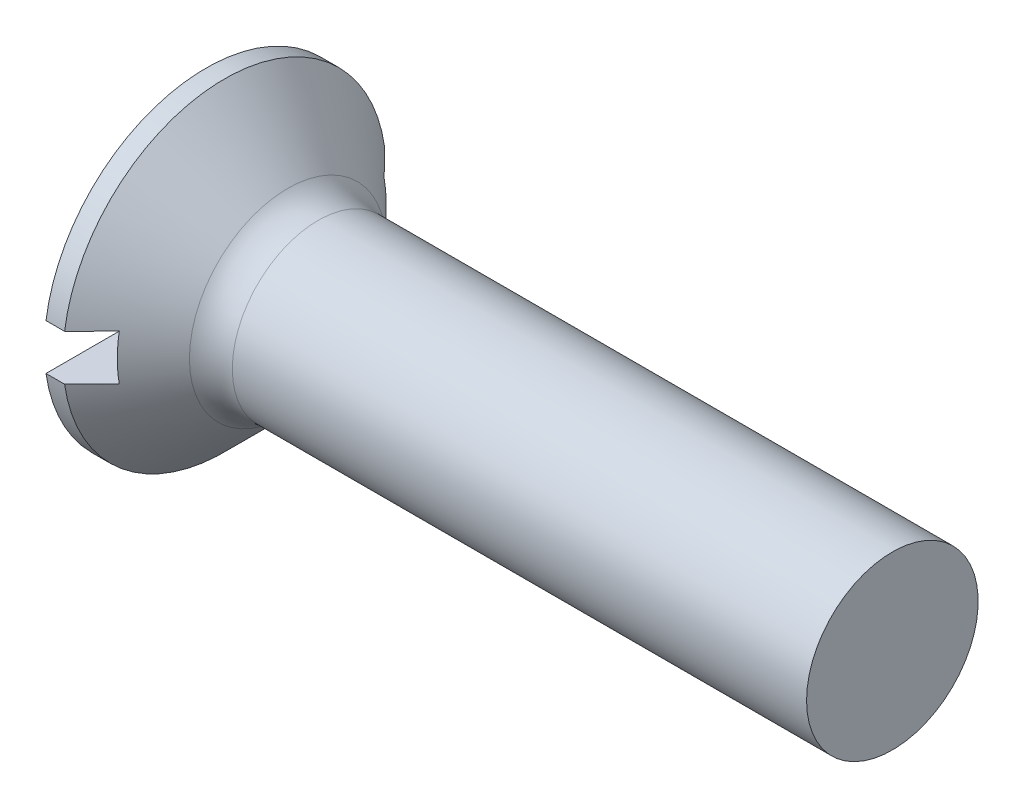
ISO-10303-21;
HEADER;
FILE_DESCRIPTION(('STEP AP214'),'2;1');
FILE_NAME('part.step','',(''),(''),'','','');
FILE_SCHEMA(('AUTOMOTIVE_DESIGN { 1 0 10303 214 1 1 1 1 }'));
ENDSEC;
DATA;
#1=APPLICATION_CONTEXT('core data for automotive mechanical design processes');
#2=APPLICATION_PROTOCOL_DEFINITION('international standard','automotive_design',2000,#1);
#3=PRODUCT_CONTEXT('',#1,'mechanical');
#4=PRODUCT('Part','Part','',(#3));
#5=PRODUCT_RELATED_PRODUCT_CATEGORY('part','',(#4));
#6=PRODUCT_DEFINITION_FORMATION('','',#4);
#7=PRODUCT_DEFINITION_CONTEXT('part definition',#1,'design');
#8=PRODUCT_DEFINITION('design','',#6,#7);
#9=PRODUCT_DEFINITION_SHAPE('','',#8);
#10=(LENGTH_UNIT() NAMED_UNIT(*) SI_UNIT(.MILLI.,.METRE.));
#11=(NAMED_UNIT(*) PLANE_ANGLE_UNIT() SI_UNIT($,.RADIAN.));
#12=(NAMED_UNIT(*) SI_UNIT($,.STERADIAN.) SOLID_ANGLE_UNIT());
#13=UNCERTAINTY_MEASURE_WITH_UNIT(LENGTH_MEASURE(1.E-05),#10,'distance_accuracy_value','');
#14=(GEOMETRIC_REPRESENTATION_CONTEXT(3) GLOBAL_UNCERTAINTY_ASSIGNED_CONTEXT((#13)) GLOBAL_UNIT_ASSIGNED_CONTEXT((#10,
#11,#12)) REPRESENTATION_CONTEXT('',''));
#15=CARTESIAN_POINT('',(0.,0.,0.));
#16=DIRECTION('',(0.,0.,1.));
#17=DIRECTION('',(1.,0.,0.));
#18=AXIS2_PLACEMENT_3D('',#15,#16,#17);
#19=CARTESIAN_POINT('',(0.,0.,0.));
#20=DIRECTION('',(-1.,0.,0.));
#21=DIRECTION('',(0.,0.,1.));
#22=AXIS2_PLACEMENT_3D('',#19,#20,#21);
#23=PLANE('',#22);
#24=DIRECTION('',(0.,0.,-1.));
#25=VECTOR('',#24,1.);
#26=CARTESIAN_POINT('',(0.,0.800000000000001,5.65));
#27=LINE('',#26,#25);
#28=CARTESIAN_POINT('',(0.,0.800000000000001,5.593076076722));
#29=VERTEX_POINT('',#28);
#30=CARTESIAN_POINT('',(0.,0.799999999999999,-5.593076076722));
#31=VERTEX_POINT('',#30);
#32=EDGE_CURVE('E170',#29,#31,#27,.T.);
#33=ORIENTED_EDGE('',*,*,#32,.F.);
#34=CARTESIAN_POINT('',(0.,0.,0.));
#35=DIRECTION('',(-1.,0.,0.));
#36=DIRECTION('',(0.,0.,1.));
#37=AXIS2_PLACEMENT_3D('',#34,#35,#36);
#38=CIRCLE('',#37,5.65);
#39=EDGE_CURVE('E114',#29,#31,#38,.T.);
#40=ORIENTED_EDGE('',*,*,#39,.T.);
#41=EDGE_LOOP('',(#33,#40));
#42=FACE_BOUND('',#41,.T.);
#43=ADVANCED_FACE('F33',(#42),#23,.T.);
#44=CARTESIAN_POINT('',(-6.34999999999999,0.,0.));
#45=DIRECTION('',(-1.,0.,0.));
#46=DIRECTION('',(0.,0.,1.));
#47=AXIS2_PLACEMENT_3D('',#44,#45,#46);
#48=CYLINDRICAL_SURFACE('',#47,5.65);
#49=DIRECTION('',(-1.,0.,0.));
#50=VECTOR('',#49,1.);
#51=CARTESIAN_POINT('',(-6.34999999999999,0.799999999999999,-5.593076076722));
#52=LINE('',#51,#50);
#53=CARTESIAN_POINT('',(0.650000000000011,0.799999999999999,-5.593076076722));
#54=VERTEX_POINT('',#53);
#55=EDGE_CURVE('E61',#31,#54,#52,.F.);
#56=ORIENTED_EDGE('',*,*,#55,.F.);
#57=ORIENTED_EDGE('',*,*,#39,.F.);
#58=DIRECTION('',(-1.,0.,0.));
#59=VECTOR('',#58,1.);
#60=CARTESIAN_POINT('',(-6.34999999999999,0.800000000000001,5.593076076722));
#61=LINE('',#60,#59);
#62=CARTESIAN_POINT('',(0.650000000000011,0.800000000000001,5.59307607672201));
#63=VERTEX_POINT('',#62);
#64=EDGE_CURVE('E176',#63,#29,#61,.T.);
#65=ORIENTED_EDGE('',*,*,#64,.F.);
#66=CARTESIAN_POINT('',(0.650000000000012,0.,0.));
#67=DIRECTION('',(-1.,0.,0.));
#68=DIRECTION('',(0.,0.,1.));
#69=AXIS2_PLACEMENT_3D('',#66,#67,#68);
#70=CIRCLE('',#69,5.65);
#71=EDGE_CURVE('E108',#63,#54,#70,.T.);
#72=ORIENTED_EDGE('',*,*,#71,.T.);
#73=EDGE_LOOP('',(#56,#57,#65,#72));
#74=FACE_BOUND('',#73,.T.);
#75=ADVANCED_FACE('F154',(#74),#48,.T.);
#76=DIRECTION('',(0.,0.,1.));
#77=VECTOR('',#76,1.);
#78=CARTESIAN_POINT('',(0.,-0.800000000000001,-5.65));
#79=LINE('',#78,#77);
#80=CARTESIAN_POINT('',(0.,-0.800000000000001,-5.593076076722));
#81=VERTEX_POINT('',#80);
#82=CARTESIAN_POINT('',(0.,-0.800000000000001,5.593076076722));
#83=VERTEX_POINT('',#82);
#84=EDGE_CURVE('E102',#81,#83,#79,.T.);
#85=ORIENTED_EDGE('',*,*,#84,.F.);
#86=EDGE_CURVE('E110',#81,#83,#38,.T.);
#87=ORIENTED_EDGE('',*,*,#86,.T.);
#88=EDGE_LOOP('',(#85,#87));
#89=FACE_BOUND('',#88,.T.);
#90=ADVANCED_FACE('F156',(#89),#23,.T.);
#91=DIRECTION('',(-1.,0.,0.));
#92=VECTOR('',#91,1.);
#93=CARTESIAN_POINT('',(-6.34999999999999,-0.800000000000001,5.593076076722));
#94=LINE('',#93,#92);
#95=CARTESIAN_POINT('',(0.650000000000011,-0.800000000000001,5.593076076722));
#96=VERTEX_POINT('',#95);
#97=EDGE_CURVE('E175',#83,#96,#94,.F.);
#98=ORIENTED_EDGE('',*,*,#97,.F.);
#99=ORIENTED_EDGE('',*,*,#86,.F.);
#100=DIRECTION('',(-1.,0.,0.));
#101=VECTOR('',#100,1.);
#102=CARTESIAN_POINT('',(-6.34999999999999,-0.800000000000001,-5.593076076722));
#103=LINE('',#102,#101);
#104=CARTESIAN_POINT('',(0.650000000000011,-0.800000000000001,-5.59307607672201));
#105=VERTEX_POINT('',#104);
#106=EDGE_CURVE('E173',#105,#81,#103,.T.);
#107=ORIENTED_EDGE('',*,*,#106,.F.);
#108=EDGE_CURVE('E111',#105,#96,#70,.T.);
#109=ORIENTED_EDGE('',*,*,#108,.T.);
#110=EDGE_LOOP('',(#98,#99,#107,#109));
#111=FACE_BOUND('',#110,.T.);
#112=ADVANCED_FACE('F151',(#111),#48,.T.);
#113=CARTESIAN_POINT('',(0.650000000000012,0.,0.));
#114=DIRECTION('',(-1.,0.,0.));
#115=DIRECTION('',(0.,0.,1.));
#116=AXIS2_PLACEMENT_3D('',#113,#114,#115);
#117=CONICAL_SURFACE('',#116,5.65,0.78539816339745);
#118=CARTESIAN_POINT('',(-6.15411798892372,0.799999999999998,-12.4283971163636));
#119=CARTESIAN_POINT('',(-5.72840936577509,0.799999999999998,-12.0018006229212));
#120=CARTESIAN_POINT('',(-5.30273955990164,0.799999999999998,-11.5751653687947));
#121=CARTESIAN_POINT('',(-4.45151919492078,0.799999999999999,-10.7217600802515));
#122=CARTESIAN_POINT('',(-4.0259686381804,0.799999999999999,-10.2949900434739));
#123=CARTESIAN_POINT('',(-3.17486613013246,0.799999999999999,-9.44109511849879));
#124=CARTESIAN_POINT('',(-2.74931425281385,0.799999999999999,-9.01397015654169));
#125=CARTESIAN_POINT('',(-1.89848797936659,0.799999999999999,-8.15945937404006));
#126=CARTESIAN_POINT('',(-1.47321357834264,0.799999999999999,-7.73207355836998));
#127=CARTESIAN_POINT('',(-0.615833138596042,0.799999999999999,-6.86957346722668));
#128=CARTESIAN_POINT('',(-0.183734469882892,0.799999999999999,-6.43445186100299));
#129=CARTESIAN_POINT('',(0.463821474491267,0.799999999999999,-5.78115808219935));
#130=CARTESIAN_POINT('',(0.679580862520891,0.799999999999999,-5.56328543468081));
#131=CARTESIAN_POINT('',(1.11080934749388,0.799999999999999,-5.12725542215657));
#132=CARTESIAN_POINT('',(1.32627844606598,0.799999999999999,-4.90909805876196));
#133=CARTESIAN_POINT('',(1.75673850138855,0.799999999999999,-4.4724245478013));
#134=CARTESIAN_POINT('',(1.9717295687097,0.799999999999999,-4.25390850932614));
#135=CARTESIAN_POINT('',(2.40105661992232,0.799999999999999,-3.81622451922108));
#136=CARTESIAN_POINT('',(2.61539258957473,0.799999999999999,-3.5970565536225));
#137=CARTESIAN_POINT('',(3.04295786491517,0.799999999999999,-3.15768240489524));
#138=CARTESIAN_POINT('',(3.25618727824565,0.8,-2.93747632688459));
#139=CARTESIAN_POINT('',(3.5744618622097,0.8,-2.60566790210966));
#140=CARTESIAN_POINT('',(3.68028997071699,0.8,-2.49481715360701));
#141=CARTESIAN_POINT('',(3.89117220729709,0.8,-2.27238250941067));
#142=CARTESIAN_POINT('',(3.9962263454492,0.8,-2.16079862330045));
#143=CARTESIAN_POINT('',(4.15723188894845,0.8,-1.98794766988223));
#144=CARTESIAN_POINT('',(4.2136059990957,0.8,-1.92707456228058));
#145=CARTESIAN_POINT('',(4.32589442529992,0.8,-1.80490303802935));
#146=CARTESIAN_POINT('',(4.38180873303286,0.8,-1.74360461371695));
#147=CARTESIAN_POINT('',(4.4929680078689,0.8,-1.62051315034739));
#148=CARTESIAN_POINT('',(4.54821358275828,0.8,-1.55872066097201));
#149=CARTESIAN_POINT('',(4.65786130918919,0.8,-1.43439270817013));
#150=CARTESIAN_POINT('',(4.71226349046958,0.8,-1.37185727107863));
#151=CARTESIAN_POINT('',(4.80409800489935,0.8,-1.26422341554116));
#152=CARTESIAN_POINT('',(4.84183289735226,0.8,-1.21938356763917));
#153=CARTESIAN_POINT('',(4.91649705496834,0.8,-1.12903902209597));
#154=CARTESIAN_POINT('',(4.9534263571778,0.8,-1.08353435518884));
#155=CARTESIAN_POINT('',(5.02626757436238,0.8,-0.991556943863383));
#156=CARTESIAN_POINT('',(5.06217715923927,0.8,-0.945082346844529));
#157=CARTESIAN_POINT('',(5.13244697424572,0.8,-0.850978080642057));
#158=CARTESIAN_POINT('',(5.16680749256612,0.8,-0.803348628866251));
#159=CARTESIAN_POINT('',(5.22431678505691,0.8,-0.719551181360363));
#160=CARTESIAN_POINT('',(5.24799439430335,0.8,-0.683748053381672));
#161=CARTESIAN_POINT('',(5.29369463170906,0.8,-0.611104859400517));
#162=CARTESIAN_POINT('',(5.31571771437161,0.8,-0.574265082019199));
#163=CARTESIAN_POINT('',(5.35744088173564,0.8,-0.499381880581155));
#164=CARTESIAN_POINT('',(5.3771460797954,0.8,-0.461341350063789));
#165=CARTESIAN_POINT('',(5.41336597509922,0.8,-0.383789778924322));
#166=CARTESIAN_POINT('',(5.42988361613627,0.8,-0.344280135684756));
#167=CARTESIAN_POINT('',(5.46094186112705,0.8,-0.256815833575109));
#168=CARTESIAN_POINT('',(5.47467792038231,0.8,-0.20856153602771));
#169=CARTESIAN_POINT('',(5.49381672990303,0.8,-0.110515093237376));
#170=CARTESIAN_POINT('',(5.49925037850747,0.8,-0.060729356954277));
#171=CARTESIAN_POINT('',(5.50060502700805,0.8,0.0392177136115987));
#172=CARTESIAN_POINT('',(5.49648099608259,0.8,0.0893797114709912));
#173=CARTESIAN_POINT('',(5.47960475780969,0.8,0.188284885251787));
#174=CARTESIAN_POINT('',(5.46682661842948,0.8,0.237023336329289));
#175=CARTESIAN_POINT('',(5.43411335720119,0.8,0.334650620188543));
#176=CARTESIAN_POINT('',(5.41385237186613,0.8,0.383425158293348));
#177=CARTESIAN_POINT('',(5.36862340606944,0.8,0.478778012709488));
#178=CARTESIAN_POINT('',(5.34364665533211,0.8,0.525352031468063));
#179=CARTESIAN_POINT('',(5.29038044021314,0.8,0.617035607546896));
#180=CARTESIAN_POINT('',(5.26206586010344,0.8,0.662130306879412));
#181=CARTESIAN_POINT('',(5.20333288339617,0.8,0.750853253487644));
#182=CARTESIAN_POINT('',(5.1729163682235,0.8,0.794482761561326));
#183=CARTESIAN_POINT('',(5.10778188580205,0.8,0.884555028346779));
#184=CARTESIAN_POINT('',(5.0729236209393,0.8,0.930895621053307));
#185=CARTESIAN_POINT('',(5.00196098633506,0.8,1.02261602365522));
#186=CARTESIAN_POINT('',(4.96585645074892,0.8,1.06799570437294));
#187=CARTESIAN_POINT('',(4.85617422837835,0.8,1.20309114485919));
#188=CARTESIAN_POINT('',(4.78126095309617,0.8,1.2917191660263));
#189=CARTESIAN_POINT('',(4.62929001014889,0.8,1.46737217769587));
#190=CARTESIAN_POINT('',(4.55222874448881,0.8,1.5543940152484));
#191=CARTESIAN_POINT('',(4.39684690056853,0.8,1.72725932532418));
#192=CARTESIAN_POINT('',(4.31852668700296,0.8,1.81310312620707));
#193=CARTESIAN_POINT('',(4.16128761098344,0.8,1.9837284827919));
#194=CARTESIAN_POINT('',(4.0823714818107,0.8,2.06851256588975));
#195=CARTESIAN_POINT('',(3.92393847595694,0.8,2.23752833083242));
#196=CARTESIAN_POINT('',(3.84442155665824,0.8,2.32175997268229));
#197=CARTESIAN_POINT('',(3.68503997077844,0.8,2.48972216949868));
#198=CARTESIAN_POINT('',(3.60517576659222,0.8,2.57345316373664));
#199=CARTESIAN_POINT('',(3.44512383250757,0.8,2.74060127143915));
#200=CARTESIAN_POINT('',(3.36493611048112,0.8,2.82401839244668));
#201=CARTESIAN_POINT('',(3.12470885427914,0.8,3.07317891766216));
#202=CARTESIAN_POINT('',(2.96430275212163,0.8,3.23856877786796));
#203=CARTESIAN_POINT('',(2.64287426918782,0.8,3.56874884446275));
#204=CARTESIAN_POINT('',(2.4818518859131,0.8,3.73353904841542));
#205=CARTESIAN_POINT('',(1.9981683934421,0.8,4.22731783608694));
#206=CARTESIAN_POINT('',(1.67489699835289,0.8,4.55570835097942));
#207=CARTESIAN_POINT('',(1.02739846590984,0.8,5.21181717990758));
#208=CARTESIAN_POINT('',(0.70317098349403,0.800000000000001,5.53953515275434));
#209=CARTESIAN_POINT('',(0.0542289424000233,0.800000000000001,6.1944827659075));
#210=CARTESIAN_POINT('',(-0.270485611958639,0.800000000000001,6.52171241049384));
#211=CARTESIAN_POINT('',(-0.920234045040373,0.800000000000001,7.17587674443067));
#212=CARTESIAN_POINT('',(-1.24526793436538,0.800000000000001,7.50281142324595));
#213=CARTESIAN_POINT('',(-1.8955454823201,0.800000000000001,8.15647358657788));
#214=CARTESIAN_POINT('',(-2.220789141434,0.800000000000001,8.48320107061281));
#215=CARTESIAN_POINT('',(-3.19666835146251,0.800000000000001,9.46309907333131));
#216=CARTESIAN_POINT('',(-3.84752047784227,0.800000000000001,10.1160538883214));
#217=CARTESIAN_POINT('',(-4.6364721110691,0.800000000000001,10.9071774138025));
#218=CARTESIAN_POINT('',(-4.77442315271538,0.800000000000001,11.0454942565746));
#219=CARTESIAN_POINT('',(-5.05034059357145,0.800000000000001,11.3221169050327));
#220=CARTESIAN_POINT('',(-5.18830699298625,0.800000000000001,11.4604227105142));
#221=CARTESIAN_POINT('',(-5.46424249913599,0.800000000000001,11.7370137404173));
#222=CARTESIAN_POINT('',(-5.60221160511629,0.800000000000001,11.8752989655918));
#223=CARTESIAN_POINT('',(-5.8781582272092,0.800000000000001,12.1518567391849));
#224=CARTESIAN_POINT('',(-6.01613574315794,0.800000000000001,12.2901292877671));
#225=CARTESIAN_POINT('',(-6.15411798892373,0.800000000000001,12.4283971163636));
#226=B_SPLINE_CURVE_WITH_KNOTS('',3,(#118,#119,#120,#121,#122,#123,#124,#125,#126,#127,#128,
#129,#130,#131,#132,#133,#134,#135,#136,#137,#138,#139,#140,#141,#142,#143,#144,#145,#146,#147,
#148,#149,#150,#151,#152,#153,#154,#155,#156,#157,#158,#159,#160,#161,#162,#163,#164,#165,#166,
#167,#168,#169,#170,#171,#172,#173,#174,#175,#176,#177,#178,#179,#180,#181,#182,#183,#184,#185,
#186,#187,#188,#189,#190,#191,#192,#193,#194,#195,#196,#197,#198,#199,#200,#201,#202,#203,#204,
#205,#206,#207,#208,#209,#210,#211,#212,#213,#214,#215,#216,#217,#218,#219,#220,#221,#222,#223,
#224,#225),.UNSPECIFIED.,.F.,.F.,(4,2,2,2,2,2,2,2,2,2,2,2,2,2,2,2,2,2,2,2,2,2,2,2,2,2,2,2,2,2,2,
2,2,2,2,2,2,2,2,2,2,2,2,2,2,2,2,2,2,2,2,2,2,4),(0.,1.80801318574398,3.61606002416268,
5.42486373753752,7.23363462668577,9.07329711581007,9.9931803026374,10.9130583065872,
11.8326950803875,12.7523517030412,13.6719171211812,14.1316838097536,14.5914445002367,
14.8403447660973,15.0892495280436,15.337907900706,15.5865574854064,15.7623655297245,
15.9381654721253,16.1143391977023,16.2904800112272,16.4192204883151,16.5479254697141,
16.6763409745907,16.8046373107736,16.9545930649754,17.1039893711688,17.2540909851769,
17.4046443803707,17.5627244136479,17.7211013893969,17.8807569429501,18.0402713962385,
18.2142039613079,18.3881597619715,18.7362365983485,19.0849364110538,19.4335369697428,
19.7810170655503,20.1285220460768,20.4756556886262,20.8227809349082,21.5139763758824,
22.2051746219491,23.5875972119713,24.9706017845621,26.3535941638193,27.7366341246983,
29.1196772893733,31.8854728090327,32.4715260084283,33.0575882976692,33.6436126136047,
34.2296278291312),.UNSPECIFIED.);
#227=CARTESIAN_POINT('',(1.6,0.8,4.63141447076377));
#228=VERTEX_POINT('',#227);
#229=EDGE_CURVE('E11',#228,#63,#226,.T.);
#230=ORIENTED_EDGE('',*,*,#229,.F.);
#231=CARTESIAN_POINT('',(1.6,0.,0.));
#232=DIRECTION('',(1.,0.,0.));
#233=DIRECTION('',(0.,0.,-1.));
#234=AXIS2_PLACEMENT_3D('',#231,#232,#233);
#235=CIRCLE('',#234,4.70000000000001);
#236=CARTESIAN_POINT('',(1.6,-0.800000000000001,4.63141447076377));
#237=VERTEX_POINT('',#236);
#238=EDGE_CURVE('E90',#237,#228,#235,.F.);
#239=ORIENTED_EDGE('',*,*,#238,.F.);
#240=CARTESIAN_POINT('',(-6.15411798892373,-0.800000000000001,12.4283971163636));
#241=CARTESIAN_POINT('',(-5.7284093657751,-0.800000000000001,12.0018006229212));
#242=CARTESIAN_POINT('',(-5.30273955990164,-0.800000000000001,11.5751653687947));
#243=CARTESIAN_POINT('',(-4.45151919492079,-0.800000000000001,10.7217600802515));
#244=CARTESIAN_POINT('',(-4.0259686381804,-0.800000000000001,10.2949900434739));
#245=CARTESIAN_POINT('',(-3.17486613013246,-0.800000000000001,9.4410951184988));
#246=CARTESIAN_POINT('',(-2.74931425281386,-0.800000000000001,9.0139701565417));
#247=CARTESIAN_POINT('',(-1.89848797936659,-0.800000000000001,8.15945937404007));
#248=CARTESIAN_POINT('',(-1.47321357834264,-0.800000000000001,7.73207355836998));
#249=CARTESIAN_POINT('',(-0.615833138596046,-0.800000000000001,6.86957346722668));
#250=CARTESIAN_POINT('',(-0.183734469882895,-0.800000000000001,6.434451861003));
#251=CARTESIAN_POINT('',(0.463821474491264,-0.800000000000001,5.78115808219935));
#252=CARTESIAN_POINT('',(0.679580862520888,-0.800000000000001,5.56328543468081));
#253=CARTESIAN_POINT('',(1.11080934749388,-0.800000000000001,5.12725542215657));
#254=CARTESIAN_POINT('',(1.32627844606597,-0.800000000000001,4.90909805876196));
#255=CARTESIAN_POINT('',(1.75673850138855,-0.800000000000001,4.4724245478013));
#256=CARTESIAN_POINT('',(1.9717295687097,-0.800000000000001,4.25390850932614));
#257=CARTESIAN_POINT('',(2.40105661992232,-0.800000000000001,3.81622451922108));
#258=CARTESIAN_POINT('',(2.61539258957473,-0.800000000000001,3.5970565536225));
#259=CARTESIAN_POINT('',(3.04295786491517,-0.800000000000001,3.15768240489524));
#260=CARTESIAN_POINT('',(3.25618727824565,-0.800000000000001,2.93747632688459));
#261=CARTESIAN_POINT('',(3.5744618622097,-0.800000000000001,2.60566790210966));
#262=CARTESIAN_POINT('',(3.68028997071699,-0.800000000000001,2.49481715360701));
#263=CARTESIAN_POINT('',(3.89117220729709,-0.800000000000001,2.27238250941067));
#264=CARTESIAN_POINT('',(3.9962263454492,-0.800000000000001,2.16079862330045));
#265=CARTESIAN_POINT('',(4.15723188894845,-0.800000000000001,1.98794766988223));
#266=CARTESIAN_POINT('',(4.2136059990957,-0.800000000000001,1.92707456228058));
#267=CARTESIAN_POINT('',(4.32589442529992,-0.800000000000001,1.80490303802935));
#268=CARTESIAN_POINT('',(4.38180873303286,-0.800000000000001,1.74360461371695));
#269=CARTESIAN_POINT('',(4.4929680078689,-0.800000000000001,1.62051315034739));
#270=CARTESIAN_POINT('',(4.54821358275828,-0.800000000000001,1.55872066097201));
#271=CARTESIAN_POINT('',(4.65786130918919,-0.800000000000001,1.43439270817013));
#272=CARTESIAN_POINT('',(4.71226349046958,-0.800000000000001,1.37185727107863));
#273=CARTESIAN_POINT('',(4.80409800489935,-0.800000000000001,1.26422341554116));
#274=CARTESIAN_POINT('',(4.84183289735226,-0.800000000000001,1.21938356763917));
#275=CARTESIAN_POINT('',(4.91649705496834,-0.800000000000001,1.12903902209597));
#276=CARTESIAN_POINT('',(4.9534263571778,-0.800000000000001,1.08353435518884));
#277=CARTESIAN_POINT('',(5.02626757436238,-0.800000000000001,0.991556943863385));
#278=CARTESIAN_POINT('',(5.06217715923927,-0.800000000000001,0.945082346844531));
#279=CARTESIAN_POINT('',(5.13244697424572,-0.800000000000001,0.850978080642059));
#280=CARTESIAN_POINT('',(5.16680749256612,-0.800000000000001,0.803348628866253));
#281=CARTESIAN_POINT('',(5.22431678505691,-0.800000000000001,0.719551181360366));
#282=CARTESIAN_POINT('',(5.24799439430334,-0.800000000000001,0.683748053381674));
#283=CARTESIAN_POINT('',(5.29369463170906,-0.800000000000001,0.61110485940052));
#284=CARTESIAN_POINT('',(5.31571771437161,-0.800000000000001,0.574265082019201));
#285=CARTESIAN_POINT('',(5.35744088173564,-0.800000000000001,0.499381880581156));
#286=CARTESIAN_POINT('',(5.3771460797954,-0.800000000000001,0.461341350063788));
#287=CARTESIAN_POINT('',(5.41336597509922,-0.800000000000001,0.38378977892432));
#288=CARTESIAN_POINT('',(5.42988361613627,-0.800000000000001,0.344280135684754));
#289=CARTESIAN_POINT('',(5.46094186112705,-0.800000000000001,0.256815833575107));
#290=CARTESIAN_POINT('',(5.47467792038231,-0.800000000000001,0.208561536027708));
#291=CARTESIAN_POINT('',(5.49381672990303,-0.800000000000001,0.110515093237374));
#292=CARTESIAN_POINT('',(5.49925037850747,-0.800000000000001,0.0607293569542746));
#293=CARTESIAN_POINT('',(5.50060502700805,-0.800000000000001,-0.0392177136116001));
#294=CARTESIAN_POINT('',(5.49648099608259,-0.800000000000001,-0.0893797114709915));
#295=CARTESIAN_POINT('',(5.47960475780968,-0.800000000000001,-0.188284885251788));
#296=CARTESIAN_POINT('',(5.46682661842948,-0.800000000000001,-0.237023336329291));
#297=CARTESIAN_POINT('',(5.43411335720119,-0.800000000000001,-0.334650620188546));
#298=CARTESIAN_POINT('',(5.41385237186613,-0.800000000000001,-0.383425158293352));
#299=CARTESIAN_POINT('',(5.36862340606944,-0.800000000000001,-0.478778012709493));
#300=CARTESIAN_POINT('',(5.34364665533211,-0.800000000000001,-0.525352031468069));
#301=CARTESIAN_POINT('',(5.29038044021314,-0.800000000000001,-0.617035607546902));
#302=CARTESIAN_POINT('',(5.26206586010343,-0.800000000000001,-0.662130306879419));
#303=CARTESIAN_POINT('',(5.20333288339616,-0.800000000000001,-0.750853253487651));
#304=CARTESIAN_POINT('',(5.1729163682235,-0.800000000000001,-0.794482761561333));
#305=CARTESIAN_POINT('',(5.10778188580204,-0.800000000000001,-0.884555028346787));
#306=CARTESIAN_POINT('',(5.07292362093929,-0.800000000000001,-0.930895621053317));
#307=CARTESIAN_POINT('',(5.00196098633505,-0.800000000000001,-1.02261602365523));
#308=CARTESIAN_POINT('',(4.96585645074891,-0.800000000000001,-1.06799570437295));
#309=CARTESIAN_POINT('',(4.85617422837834,-0.800000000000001,-1.2030911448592));
#310=CARTESIAN_POINT('',(4.78126095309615,-0.800000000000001,-1.29171916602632));
#311=CARTESIAN_POINT('',(4.62929001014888,-0.800000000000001,-1.46737217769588));
#312=CARTESIAN_POINT('',(4.55222874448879,-0.800000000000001,-1.55439401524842));
#313=CARTESIAN_POINT('',(4.39684690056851,-0.800000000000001,-1.7272593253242));
#314=CARTESIAN_POINT('',(4.31852668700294,-0.800000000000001,-1.81310312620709));
#315=CARTESIAN_POINT('',(4.16128761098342,-0.800000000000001,-1.98372848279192));
#316=CARTESIAN_POINT('',(4.08237148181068,-0.800000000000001,-2.06851256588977));
#317=CARTESIAN_POINT('',(3.92393847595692,-0.800000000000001,-2.23752833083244));
#318=CARTESIAN_POINT('',(3.84442155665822,-0.800000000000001,-2.32175997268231));
#319=CARTESIAN_POINT('',(3.68503997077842,-0.800000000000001,-2.48972216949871));
#320=CARTESIAN_POINT('',(3.60517576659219,-0.800000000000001,-2.57345316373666));
#321=CARTESIAN_POINT('',(3.44512383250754,-0.800000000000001,-2.74060127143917));
#322=CARTESIAN_POINT('',(3.36493611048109,-0.800000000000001,-2.82401839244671));
#323=CARTESIAN_POINT('',(3.12470885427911,-0.800000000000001,-3.07317891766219));
#324=CARTESIAN_POINT('',(2.9643027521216,-0.800000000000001,-3.238568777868));
#325=CARTESIAN_POINT('',(2.64287426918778,-0.800000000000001,-3.56874884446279));
#326=CARTESIAN_POINT('',(2.48185188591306,-0.800000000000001,-3.73353904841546));
#327=CARTESIAN_POINT('',(1.99816839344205,-0.800000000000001,-4.22731783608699));
#328=CARTESIAN_POINT('',(1.67489699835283,-0.800000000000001,-4.55570835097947));
#329=CARTESIAN_POINT('',(1.02739846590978,-0.800000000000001,-5.21181717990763));
#330=CARTESIAN_POINT('',(0.703170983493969,-0.800000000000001,-5.5395351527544));
#331=CARTESIAN_POINT('',(0.0542289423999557,-0.800000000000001,-6.19448276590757));
#332=CARTESIAN_POINT('',(-0.270485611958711,-0.800000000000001,-6.52171241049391));
#333=CARTESIAN_POINT('',(-0.920234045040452,-0.800000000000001,-7.17587674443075));
#334=CARTESIAN_POINT('',(-1.24526793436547,-0.800000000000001,-7.50281142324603));
#335=CARTESIAN_POINT('',(-1.89554548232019,-0.800000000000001,-8.15647358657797));
#336=CARTESIAN_POINT('',(-2.22078914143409,-0.800000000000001,-8.48320107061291));
#337=CARTESIAN_POINT('',(-3.19666835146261,-0.800000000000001,-9.46309907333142));
#338=CARTESIAN_POINT('',(-3.84752047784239,-0.800000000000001,-10.1160538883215));
#339=CARTESIAN_POINT('',(-4.63647211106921,-0.800000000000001,-10.9071774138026));
#340=CARTESIAN_POINT('',(-4.77442315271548,-0.800000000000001,-11.0454942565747));
#341=CARTESIAN_POINT('',(-5.05034059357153,-0.800000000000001,-11.3221169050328));
#342=CARTESIAN_POINT('',(-5.18830699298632,-0.800000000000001,-11.4604227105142));
#343=CARTESIAN_POINT('',(-5.46424249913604,-0.800000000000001,-11.7370137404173));
#344=CARTESIAN_POINT('',(-5.60221160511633,-0.800000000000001,-11.8752989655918));
#345=CARTESIAN_POINT('',(-5.87815822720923,-0.800000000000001,-12.151856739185));
#346=CARTESIAN_POINT('',(-6.01613574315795,-0.800000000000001,-12.2901292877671));
#347=CARTESIAN_POINT('',(-6.15411798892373,-0.800000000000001,-12.4283971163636));
#348=B_SPLINE_CURVE_WITH_KNOTS('',3,(#240,#241,#242,#243,#244,#245,#246,#247,#248,#249,#250,
#251,#252,#253,#254,#255,#256,#257,#258,#259,#260,#261,#262,#263,#264,#265,#266,#267,#268,#269,
#270,#271,#272,#273,#274,#275,#276,#277,#278,#279,#280,#281,#282,#283,#284,#285,#286,#287,#288,
#289,#290,#291,#292,#293,#294,#295,#296,#297,#298,#299,#300,#301,#302,#303,#304,#305,#306,#307,
#308,#309,#310,#311,#312,#313,#314,#315,#316,#317,#318,#319,#320,#321,#322,#323,#324,#325,#326,
#327,#328,#329,#330,#331,#332,#333,#334,#335,#336,#337,#338,#339,#340,#341,#342,#343,#344,#345,
#346,#347),.UNSPECIFIED.,.F.,.F.,(4,2,2,2,2,2,2,2,2,2,2,2,2,2,2,2,2,2,2,2,2,2,2,2,2,2,2,2,2,2,2,
2,2,2,2,2,2,2,2,2,2,2,2,2,2,2,2,2,2,2,2,2,2,4),(0.,1.80801318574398,3.61606002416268,
5.42486373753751,7.23363462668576,9.07329711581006,9.99318030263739,10.9130583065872,
11.8326950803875,12.7523517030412,13.6719171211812,14.1316838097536,14.5914445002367,
14.8403447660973,15.0892495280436,15.337907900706,15.5865574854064,15.7623655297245,
15.9381654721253,16.1143391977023,16.2904800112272,16.4192204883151,16.5479254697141,
16.6763409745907,16.8046373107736,16.9545930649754,17.1039893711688,17.2540909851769,
17.4046443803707,17.5627244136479,17.7211013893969,17.8807569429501,18.0402713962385,
18.2142039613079,18.3881597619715,18.7362365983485,19.0849364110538,19.4335369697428,
19.7810170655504,20.1285220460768,20.4756556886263,20.8227809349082,21.5139763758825,
22.2051746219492,23.5875972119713,24.9706017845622,26.3535941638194,27.7366341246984,
29.1196772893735,31.8854728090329,32.4715260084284,33.0575882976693,33.6436126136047,
34.2296278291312),.UNSPECIFIED.);
#349=EDGE_CURVE('E47',#96,#237,#348,.T.);
#350=ORIENTED_EDGE('',*,*,#349,.F.);
#351=ORIENTED_EDGE('',*,*,#108,.F.);
#352=CARTESIAN_POINT('',(1.6,-0.800000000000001,-4.63141447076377));
#353=VERTEX_POINT('',#352);
#354=EDGE_CURVE('E126',#353,#105,#348,.T.);
#355=ORIENTED_EDGE('',*,*,#354,.F.);
#356=CARTESIAN_POINT('',(1.6,0.799999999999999,-4.63141447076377));
#357=VERTEX_POINT('',#356);
#358=EDGE_CURVE('E98',#357,#353,#235,.F.);
#359=ORIENTED_EDGE('',*,*,#358,.F.);
#360=EDGE_CURVE('E37',#54,#357,#226,.T.);
#361=ORIENTED_EDGE('',*,*,#360,.F.);
#362=ORIENTED_EDGE('',*,*,#71,.F.);
#363=EDGE_LOOP('',(#230,#239,#350,#351,#355,#359,#361,#362));
#364=FACE_BOUND('',#363,.T.);
#365=CARTESIAN_POINT('',(2.86066017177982,0.,0.));
#366=DIRECTION('',(-1.,0.,0.));
#367=DIRECTION('',(0.,0.,1.));
#368=AXIS2_PLACEMENT_3D('',#365,#366,#367);
#369=CIRCLE('',#368,3.43933982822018);
#370=CARTESIAN_POINT('',(2.86066017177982,0.,3.43933982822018));
#371=VERTEX_POINT('',#370);
#372=EDGE_CURVE('E121',#371,#371,#369,.T.);
#373=ORIENTED_EDGE('',*,*,#372,.T.);
#374=EDGE_LOOP('',(#373));
#375=FACE_BOUND('',#374,.T.);
#376=ADVANCED_FACE('F105',(#364,#375),#117,.T.);
#377=CARTESIAN_POINT('',(-6.34999999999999,0.,0.));
#378=DIRECTION('',(-1.,0.,0.));
#379=DIRECTION('',(0.,0.,1.));
#380=AXIS2_PLACEMENT_3D('',#377,#378,#379);
#381=CYLINDRICAL_SURFACE('',#380,3.);
#382=CARTESIAN_POINT('',(3.92132034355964,0.,0.));
#383=DIRECTION('',(-1.,0.,0.));
#384=DIRECTION('',(0.,0.,1.));
#385=AXIS2_PLACEMENT_3D('',#382,#383,#384);
#386=CIRCLE('',#385,3.);
#387=CARTESIAN_POINT('',(3.92132034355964,0.,3.));
#388=VERTEX_POINT('',#387);
#389=EDGE_CURVE('E124',#388,#388,#386,.F.);
#390=ORIENTED_EDGE('',*,*,#389,.T.);
#391=EDGE_LOOP('',(#390));
#392=FACE_BOUND('',#391,.T.);
#393=CARTESIAN_POINT('',(24.,0.,0.));
#394=DIRECTION('',(-1.,0.,0.));
#395=DIRECTION('',(0.,0.,1.));
#396=AXIS2_PLACEMENT_3D('',#393,#394,#395);
#397=CIRCLE('',#396,3.);
#398=CARTESIAN_POINT('',(24.,0.,3.));
#399=VERTEX_POINT('',#398);
#400=EDGE_CURVE('E117',#399,#399,#397,.T.);
#401=ORIENTED_EDGE('',*,*,#400,.T.);
#402=EDGE_LOOP('',(#401));
#403=FACE_BOUND('',#402,.T.);
#404=ADVANCED_FACE('F144',(#392,#403),#381,.T.);
#405=CARTESIAN_POINT('',(24.,3.,0.));
#406=DIRECTION('',(1.,0.,0.));
#407=DIRECTION('',(0.,0.,-1.));
#408=AXIS2_PLACEMENT_3D('',#405,#406,#407);
#409=PLANE('',#408);
#410=ORIENTED_EDGE('',*,*,#400,.F.);
#411=EDGE_LOOP('',(#410));
#412=FACE_BOUND('',#411,.T.);
#413=ADVANCED_FACE('F142',(#412),#409,.T.);
#414=CARTESIAN_POINT('',(3.92132034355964,0.,0.));
#415=DIRECTION('',(-1.,0.,0.));
#416=DIRECTION('',(0.,0.,1.));
#417=AXIS2_PLACEMENT_3D('',#414,#415,#416);
#418=TOROIDAL_SURFACE('',#417,4.5,1.5);
#419=ORIENTED_EDGE('',*,*,#389,.F.);
#420=EDGE_LOOP('',(#419));
#421=FACE_BOUND('',#420,.T.);
#422=ORIENTED_EDGE('',*,*,#372,.F.);
#423=EDGE_LOOP('',(#422));
#424=FACE_BOUND('',#423,.T.);
#425=ADVANCED_FACE('F35',(#421,#424),#418,.F.);
#426=CARTESIAN_POINT('',(1.6,0.800000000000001,5.65));
#427=DIRECTION('',(0.,1.,0.));
#428=DIRECTION('',(0.,0.,1.));
#429=AXIS2_PLACEMENT_3D('',#426,#427,#428);
#430=PLANE('',#429);
#431=ORIENTED_EDGE('',*,*,#55,.T.);
#432=ORIENTED_EDGE('',*,*,#360,.T.);
#433=DIRECTION('',(0.,0.,-1.));
#434=VECTOR('',#433,1.);
#435=CARTESIAN_POINT('',(1.6,0.800000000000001,5.65));
#436=LINE('',#435,#434);
#437=EDGE_CURVE('E54',#228,#357,#436,.T.);
#438=ORIENTED_EDGE('',*,*,#437,.F.);
#439=ORIENTED_EDGE('',*,*,#229,.T.);
#440=ORIENTED_EDGE('',*,*,#64,.T.);
#441=ORIENTED_EDGE('',*,*,#32,.T.);
#442=EDGE_LOOP('',(#431,#432,#438,#439,#440,#441));
#443=FACE_BOUND('',#442,.T.);
#444=ADVANCED_FACE('F99',(#443),#430,.F.);
#445=CARTESIAN_POINT('',(1.6,-0.800000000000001,-5.65));
#446=DIRECTION('',(0.,-1.,0.));
#447=DIRECTION('',(0.,0.,-1.));
#448=AXIS2_PLACEMENT_3D('',#445,#446,#447);
#449=PLANE('',#448);
#450=ORIENTED_EDGE('',*,*,#97,.T.);
#451=ORIENTED_EDGE('',*,*,#349,.T.);
#452=DIRECTION('',(0.,0.,1.));
#453=VECTOR('',#452,1.);
#454=CARTESIAN_POINT('',(1.6,-0.800000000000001,-5.65));
#455=LINE('',#454,#453);
#456=EDGE_CURVE('E93',#353,#237,#455,.T.);
#457=ORIENTED_EDGE('',*,*,#456,.F.);
#458=ORIENTED_EDGE('',*,*,#354,.T.);
#459=ORIENTED_EDGE('',*,*,#106,.T.);
#460=ORIENTED_EDGE('',*,*,#84,.T.);
#461=EDGE_LOOP('',(#450,#451,#457,#458,#459,#460));
#462=FACE_BOUND('',#461,.T.);
#463=ADVANCED_FACE('F134',(#462),#449,.F.);
#464=CARTESIAN_POINT('',(1.6,-0.800000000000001,-5.65));
#465=DIRECTION('',(1.,0.,0.));
#466=DIRECTION('',(0.,0.,-1.));
#467=AXIS2_PLACEMENT_3D('',#464,#465,#466);
#468=PLANE('',#467);
#469=ORIENTED_EDGE('',*,*,#238,.T.);
#470=ORIENTED_EDGE('',*,*,#437,.T.);
#471=ORIENTED_EDGE('',*,*,#358,.T.);
#472=ORIENTED_EDGE('',*,*,#456,.T.);
#473=EDGE_LOOP('',(#469,#470,#471,#472));
#474=FACE_BOUND('',#473,.T.);
#475=ADVANCED_FACE('F91',(#474),#468,.F.);
#476=CLOSED_SHELL('',(#43,#75,#90,#112,#376,#404,#413,#425,#444,#463,#475));
#477=MANIFOLD_SOLID_BREP('B2',#476);
#478=ADVANCED_BREP_SHAPE_REPRESENTATION('',(#18,#477),#14);
#479=SHAPE_DEFINITION_REPRESENTATION(#9,#478);
ENDSEC;
END-ISO-10303-21;
